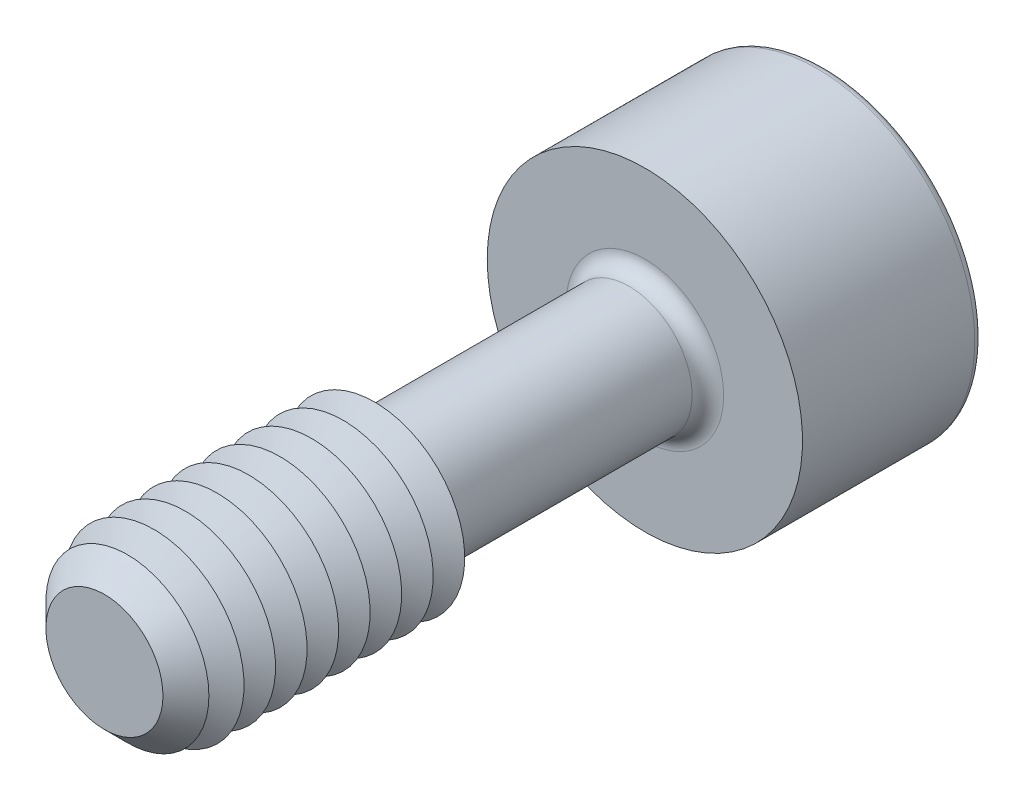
ISO-10303-21;
HEADER;
FILE_DESCRIPTION(('STEP AP214'),'2;1');
FILE_NAME('part.step','',(''),(''),'','','');
FILE_SCHEMA(('AUTOMOTIVE_DESIGN { 1 0 10303 214 1 1 1 1 }'));
ENDSEC;
DATA;
#1=APPLICATION_CONTEXT('core data for automotive mechanical design processes');
#2=APPLICATION_PROTOCOL_DEFINITION('international standard','automotive_design',2000,#1);
#3=PRODUCT_CONTEXT('',#1,'mechanical');
#4=PRODUCT('Part','Part','',(#3));
#5=PRODUCT_RELATED_PRODUCT_CATEGORY('part','',(#4));
#6=PRODUCT_DEFINITION_FORMATION('','',#4);
#7=PRODUCT_DEFINITION_CONTEXT('part definition',#1,'design');
#8=PRODUCT_DEFINITION('design','',#6,#7);
#9=PRODUCT_DEFINITION_SHAPE('','',#8);
#10=(LENGTH_UNIT() NAMED_UNIT(*) SI_UNIT(.MILLI.,.METRE.));
#11=(NAMED_UNIT(*) PLANE_ANGLE_UNIT() SI_UNIT($,.RADIAN.));
#12=(NAMED_UNIT(*) SI_UNIT($,.STERADIAN.) SOLID_ANGLE_UNIT());
#13=UNCERTAINTY_MEASURE_WITH_UNIT(LENGTH_MEASURE(1.E-05),#10,'distance_accuracy_value','');
#14=(GEOMETRIC_REPRESENTATION_CONTEXT(3) GLOBAL_UNCERTAINTY_ASSIGNED_CONTEXT((#13)) GLOBAL_UNIT_ASSIGNED_CONTEXT((#10,
#11,#12)) REPRESENTATION_CONTEXT('',''));
#15=CARTESIAN_POINT('',(0.,0.,0.));
#16=DIRECTION('',(0.,0.,1.));
#17=DIRECTION('',(1.,0.,0.));
#18=AXIS2_PLACEMENT_3D('',#15,#16,#17);
#19=CARTESIAN_POINT('',(-0.866025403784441,-1.5,-7.));
#20=DIRECTION('',(0.,0.,1.));
#21=DIRECTION('',(1.,0.,0.));
#22=AXIS2_PLACEMENT_3D('',#19,#20,#21);
#23=PLANE('',#22);
#24=DIRECTION('',(1.,0.,0.));
#25=VECTOR('',#24,1.);
#26=CARTESIAN_POINT('',(-0.866025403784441,-1.5,-7.));
#27=LINE('',#26,#25);
#28=CARTESIAN_POINT('',(0.,-1.5,-7.));
#29=VERTEX_POINT('',#28);
#30=CARTESIAN_POINT('',(0.866025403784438,-1.5,-7.));
#31=VERTEX_POINT('',#30);
#32=EDGE_CURVE('E765',#29,#31,#27,.T.);
#33=ORIENTED_EDGE('',*,*,#32,.F.);
#34=CARTESIAN_POINT('',(0.,0.,-7.));
#35=DIRECTION('',(0.,0.,1.));
#36=DIRECTION('',(0.,-1.,0.));
#37=AXIS2_PLACEMENT_3D('',#34,#35,#36);
#38=CIRCLE('',#37,1.5);
#39=CARTESIAN_POINT('',(1.29903810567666,-0.750000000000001,-7.));
#40=VERTEX_POINT('',#39);
#41=EDGE_CURVE('E53',#29,#40,#38,.T.);
#42=ORIENTED_EDGE('',*,*,#41,.T.);
#43=DIRECTION('',(0.5,0.866025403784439,0.));
#44=VECTOR('',#43,1.);
#45=CARTESIAN_POINT('',(0.866025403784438,-1.5,-7.));
#46=LINE('',#45,#44);
#47=EDGE_CURVE('E750',#31,#40,#46,.T.);
#48=ORIENTED_EDGE('',*,*,#47,.F.);
#49=EDGE_LOOP('',(#33,#42,#48));
#50=FACE_BOUND('',#49,.T.);
#51=ADVANCED_FACE('F41',(#50),#23,.F.);
#52=CARTESIAN_POINT('',(1.73205080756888,0.,-7.));
#53=VERTEX_POINT('',#52);
#54=EDGE_CURVE('E761',#40,#53,#46,.T.);
#55=ORIENTED_EDGE('',*,*,#54,.F.);
#56=CARTESIAN_POINT('',(1.29903810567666,0.75,-7.));
#57=VERTEX_POINT('',#56);
#58=EDGE_CURVE('E11',#40,#57,#38,.T.);
#59=ORIENTED_EDGE('',*,*,#58,.T.);
#60=DIRECTION('',(-0.5,0.866025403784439,0.));
#61=VECTOR('',#60,1.);
#62=CARTESIAN_POINT('',(1.73205080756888,0.,-7.));
#63=LINE('',#62,#61);
#64=EDGE_CURVE('E749',#53,#57,#63,.T.);
#65=ORIENTED_EDGE('',*,*,#64,.F.);
#66=EDGE_LOOP('',(#55,#59,#65));
#67=FACE_BOUND('',#66,.T.);
#68=ADVANCED_FACE('F133',(#67),#23,.F.);
#69=CARTESIAN_POINT('',(0.866025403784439,1.5,-7.));
#70=VERTEX_POINT('',#69);
#71=EDGE_CURVE('E744',#57,#70,#63,.T.);
#72=ORIENTED_EDGE('',*,*,#71,.F.);
#73=CARTESIAN_POINT('',(0.,1.5,-7.));
#74=VERTEX_POINT('',#73);
#75=EDGE_CURVE('E51',#57,#74,#38,.T.);
#76=ORIENTED_EDGE('',*,*,#75,.T.);
#77=DIRECTION('',(-1.,0.,0.));
#78=VECTOR('',#77,1.);
#79=CARTESIAN_POINT('',(0.866025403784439,1.5,-7.));
#80=LINE('',#79,#78);
#81=EDGE_CURVE('E177',#70,#74,#80,.T.);
#82=ORIENTED_EDGE('',*,*,#81,.F.);
#83=EDGE_LOOP('',(#72,#76,#82));
#84=FACE_BOUND('',#83,.T.);
#85=ADVANCED_FACE('F139',(#84),#23,.F.);
#86=CARTESIAN_POINT('',(-0.866025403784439,1.5,-7.));
#87=VERTEX_POINT('',#86);
#88=EDGE_CURVE('E755',#74,#87,#80,.T.);
#89=ORIENTED_EDGE('',*,*,#88,.F.);
#90=CARTESIAN_POINT('',(-1.29903810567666,0.750000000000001,-7.));
#91=VERTEX_POINT('',#90);
#92=EDGE_CURVE('E265',#74,#91,#38,.T.);
#93=ORIENTED_EDGE('',*,*,#92,.T.);
#94=DIRECTION('',(-0.5,-0.866025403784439,0.));
#95=VECTOR('',#94,1.);
#96=CARTESIAN_POINT('',(-0.866025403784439,1.5,-7.));
#97=LINE('',#96,#95);
#98=EDGE_CURVE('E176',#87,#91,#97,.T.);
#99=ORIENTED_EDGE('',*,*,#98,.F.);
#100=EDGE_LOOP('',(#89,#93,#99));
#101=FACE_BOUND('',#100,.T.);
#102=ADVANCED_FACE('F157',(#101),#23,.F.);
#103=CARTESIAN_POINT('',(-1.73205080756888,0.,-7.));
#104=VERTEX_POINT('',#103);
#105=EDGE_CURVE('E170',#91,#104,#97,.T.);
#106=ORIENTED_EDGE('',*,*,#105,.F.);
#107=CARTESIAN_POINT('',(-1.29903810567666,-0.75,-7.));
#108=VERTEX_POINT('',#107);
#109=EDGE_CURVE('E172',#91,#108,#38,.T.);
#110=ORIENTED_EDGE('',*,*,#109,.T.);
#111=DIRECTION('',(0.5,-0.866025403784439,0.));
#112=VECTOR('',#111,1.);
#113=CARTESIAN_POINT('',(-1.73205080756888,0.,-7.));
#114=LINE('',#113,#112);
#115=EDGE_CURVE('E174',#104,#108,#114,.T.);
#116=ORIENTED_EDGE('',*,*,#115,.F.);
#117=EDGE_LOOP('',(#106,#110,#116));
#118=FACE_BOUND('',#117,.T.);
#119=ADVANCED_FACE('F146',(#118),#23,.F.);
#120=CARTESIAN_POINT('',(0.,0.,-10.));
#121=DIRECTION('',(0.,0.,-1.));
#122=DIRECTION('',(-1.,0.,0.));
#123=AXIS2_PLACEMENT_3D('',#120,#121,#122);
#124=PLANE('',#123);
#125=CARTESIAN_POINT('',(0.,0.,-10.));
#126=DIRECTION('',(0.,0.,-1.));
#127=DIRECTION('',(-1.,0.,0.));
#128=AXIS2_PLACEMENT_3D('',#125,#126,#127);
#129=CIRCLE('',#128,3.325);
#130=CARTESIAN_POINT('',(-3.325,0.,-10.));
#131=VERTEX_POINT('',#130);
#132=EDGE_CURVE('E251',#131,#131,#129,.T.);
#133=ORIENTED_EDGE('',*,*,#132,.T.);
#134=EDGE_LOOP('',(#133));
#135=FACE_BOUND('',#134,.T.);
#136=DIRECTION('',(-0.5,-0.866025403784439,0.));
#137=VECTOR('',#136,1.);
#138=CARTESIAN_POINT('',(-0.866025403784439,1.5,-10.));
#139=LINE('',#138,#137);
#140=CARTESIAN_POINT('',(-0.866025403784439,1.5,-10.));
#141=VERTEX_POINT('',#140);
#142=CARTESIAN_POINT('',(-1.73205080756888,0.,-10.));
#143=VERTEX_POINT('',#142);
#144=EDGE_CURVE('E212',#141,#143,#139,.T.);
#145=ORIENTED_EDGE('',*,*,#144,.T.);
#146=DIRECTION('',(0.5,-0.866025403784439,0.));
#147=VECTOR('',#146,1.);
#148=CARTESIAN_POINT('',(-1.73205080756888,0.,-10.));
#149=LINE('',#148,#147);
#150=CARTESIAN_POINT('',(-0.866025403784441,-1.5,-10.));
#151=VERTEX_POINT('',#150);
#152=EDGE_CURVE('E67',#143,#151,#149,.T.);
#153=ORIENTED_EDGE('',*,*,#152,.T.);
#154=DIRECTION('',(1.,0.,0.));
#155=VECTOR('',#154,1.);
#156=CARTESIAN_POINT('',(-0.866025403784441,-1.5,-10.));
#157=LINE('',#156,#155);
#158=CARTESIAN_POINT('',(0.866025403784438,-1.5,-10.));
#159=VERTEX_POINT('',#158);
#160=EDGE_CURVE('E196',#151,#159,#157,.T.);
#161=ORIENTED_EDGE('',*,*,#160,.T.);
#162=DIRECTION('',(0.5,0.866025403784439,0.));
#163=VECTOR('',#162,1.);
#164=CARTESIAN_POINT('',(0.866025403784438,-1.5,-10.));
#165=LINE('',#164,#163);
#166=CARTESIAN_POINT('',(1.73205080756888,0.,-10.));
#167=VERTEX_POINT('',#166);
#168=EDGE_CURVE('E200',#159,#167,#165,.T.);
#169=ORIENTED_EDGE('',*,*,#168,.T.);
#170=DIRECTION('',(-0.5,0.866025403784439,0.));
#171=VECTOR('',#170,1.);
#172=CARTESIAN_POINT('',(1.73205080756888,0.,-10.));
#173=LINE('',#172,#171);
#174=CARTESIAN_POINT('',(0.866025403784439,1.5,-10.));
#175=VERTEX_POINT('',#174);
#176=EDGE_CURVE('E204',#167,#175,#173,.T.);
#177=ORIENTED_EDGE('',*,*,#176,.T.);
#178=DIRECTION('',(-1.,0.,0.));
#179=VECTOR('',#178,1.);
#180=CARTESIAN_POINT('',(0.866025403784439,1.5,-10.));
#181=LINE('',#180,#179);
#182=EDGE_CURVE('E208',#175,#141,#181,.T.);
#183=ORIENTED_EDGE('',*,*,#182,.T.);
#184=EDGE_LOOP('',(#145,#153,#161,#169,#177,#183));
#185=FACE_BOUND('',#184,.T.);
#186=ADVANCED_FACE('F156',(#135,#185),#124,.T.);
#187=CARTESIAN_POINT('',(0.,0.,6.));
#188=DIRECTION('',(0.,0.,-1.));
#189=DIRECTION('',(-1.,0.,0.));
#190=AXIS2_PLACEMENT_3D('',#187,#188,#189);
#191=CYLINDRICAL_SURFACE('',#190,1.4);
#192=CARTESIAN_POINT('',(0.,0.,-5.65));
#193=DIRECTION('',(0.,0.,-1.));
#194=DIRECTION('',(-1.,0.,0.));
#195=AXIS2_PLACEMENT_3D('',#192,#193,#194);
#196=CIRCLE('',#195,1.4);
#197=CARTESIAN_POINT('',(-1.4,0.,-5.65));
#198=VERTEX_POINT('',#197);
#199=EDGE_CURVE('E247',#198,#198,#196,.F.);
#200=ORIENTED_EDGE('',*,*,#199,.T.);
#201=EDGE_LOOP('',(#200));
#202=FACE_BOUND('',#201,.T.);
#203=CARTESIAN_POINT('',(0.,0.,-0.346410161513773));
#204=DIRECTION('',(0.,0.,-1.));
#205=DIRECTION('',(0.,1.,0.));
#206=AXIS2_PLACEMENT_3D('',#203,#204,#205);
#207=CIRCLE('',#206,1.4);
#208=CARTESIAN_POINT('',(0.,1.4,-0.346410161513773));
#209=VERTEX_POINT('',#208);
#210=EDGE_CURVE('E235',#209,#209,#207,.T.);
#211=ORIENTED_EDGE('',*,*,#210,.T.);
#212=EDGE_LOOP('',(#211));
#213=FACE_BOUND('',#212,.T.);
#214=ADVANCED_FACE('F163',(#202,#213),#191,.T.);
#215=CARTESIAN_POINT('',(0.,0.,-0.346410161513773));
#216=DIRECTION('',(0.,0.,1.));
#217=DIRECTION('',(0.,-1.,0.));
#218=AXIS2_PLACEMENT_3D('',#215,#216,#217);
#219=CONICAL_SURFACE('',#218,1.4,1.0471975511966);
#220=CARTESIAN_POINT('',(0.,0.,0.));
#221=DIRECTION('',(0.,0.,-1.));
#222=DIRECTION('',(-1.,0.,0.));
#223=AXIS2_PLACEMENT_3D('',#220,#221,#222);
#224=CIRCLE('',#223,2.);
#225=CARTESIAN_POINT('',(-2.,0.,0.));
#226=VERTEX_POINT('',#225);
#227=EDGE_CURVE('E269',#226,#226,#224,.T.);
#228=ORIENTED_EDGE('',*,*,#227,.T.);
#229=EDGE_LOOP('',(#228));
#230=FACE_BOUND('',#229,.T.);
#231=ORIENTED_EDGE('',*,*,#210,.F.);
#232=EDGE_LOOP('',(#231));
#233=FACE_BOUND('',#232,.T.);
#234=ADVANCED_FACE('F513',(#230,#233),#219,.T.);
#235=CARTESIAN_POINT('',(0.,0.,-6.));
#236=DIRECTION('',(0.,0.,-1.));
#237=DIRECTION('',(-1.,0.,0.));
#238=AXIS2_PLACEMENT_3D('',#235,#236,#237);
#239=PLANE('',#238);
#240=CARTESIAN_POINT('',(0.,0.,-6.));
#241=DIRECTION('',(0.,0.,-1.));
#242=DIRECTION('',(-1.,0.,0.));
#243=AXIS2_PLACEMENT_3D('',#240,#241,#242);
#244=CIRCLE('',#243,1.75);
#245=CARTESIAN_POINT('',(-1.75,0.,-6.));
#246=VERTEX_POINT('',#245);
#247=EDGE_CURVE('E243',#246,#246,#244,.T.);
#248=ORIENTED_EDGE('',*,*,#247,.T.);
#249=EDGE_LOOP('',(#248));
#250=FACE_BOUND('',#249,.T.);
#251=CARTESIAN_POINT('',(0.,0.,-6.));
#252=DIRECTION('',(0.,0.,-1.));
#253=DIRECTION('',(-1.,0.,0.));
#254=AXIS2_PLACEMENT_3D('',#251,#252,#253);
#255=CIRCLE('',#254,3.5);
#256=CARTESIAN_POINT('',(-3.5,0.,-6.));
#257=VERTEX_POINT('',#256);
#258=EDGE_CURVE('E231',#257,#257,#255,.T.);
#259=ORIENTED_EDGE('',*,*,#258,.F.);
#260=EDGE_LOOP('',(#259));
#261=FACE_BOUND('',#260,.T.);
#262=ADVANCED_FACE('F506',(#250,#261),#239,.F.);
#263=CARTESIAN_POINT('',(0.,0.,-10.));
#264=DIRECTION('',(0.,0.,1.));
#265=DIRECTION('',(1.,0.,0.));
#266=AXIS2_PLACEMENT_3D('',#263,#264,#265);
#267=CYLINDRICAL_SURFACE('',#266,3.5);
#268=CARTESIAN_POINT('',(0.,0.,-9.825));
#269=DIRECTION('',(0.,0.,-1.));
#270=DIRECTION('',(-1.,0.,0.));
#271=AXIS2_PLACEMENT_3D('',#268,#269,#270);
#272=CIRCLE('',#271,3.5);
#273=CARTESIAN_POINT('',(-3.5,0.,-9.825));
#274=VERTEX_POINT('',#273);
#275=EDGE_CURVE('E254',#274,#274,#272,.F.);
#276=ORIENTED_EDGE('',*,*,#275,.T.);
#277=EDGE_LOOP('',(#276));
#278=FACE_BOUND('',#277,.T.);
#279=ORIENTED_EDGE('',*,*,#258,.T.);
#280=EDGE_LOOP('',(#279));
#281=FACE_BOUND('',#280,.T.);
#282=ADVANCED_FACE('F512',(#278,#281),#267,.T.);
#283=CARTESIAN_POINT('',(-1.73205080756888,0.,-7.));
#284=DIRECTION('',(0.866025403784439,0.5,0.));
#285=DIRECTION('',(-0.5,0.866025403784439,0.));
#286=AXIS2_PLACEMENT_3D('',#283,#284,#285);
#287=PLANE('',#286);
#288=ORIENTED_EDGE('',*,*,#152,.F.);
#289=DIRECTION('',(0.,0.,-1.));
#290=VECTOR('',#289,1.);
#291=CARTESIAN_POINT('',(-1.73205080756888,0.,-7.));
#292=LINE('',#291,#290);
#293=EDGE_CURVE('E186',#104,#143,#292,.T.);
#294=ORIENTED_EDGE('',*,*,#293,.F.);
#295=ORIENTED_EDGE('',*,*,#115,.T.);
#296=CARTESIAN_POINT('',(-0.866025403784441,-1.5,-7.));
#297=VERTEX_POINT('',#296);
#298=EDGE_CURVE('E215',#108,#297,#114,.T.);
#299=ORIENTED_EDGE('',*,*,#298,.T.);
#300=DIRECTION('',(0.,0.,-1.));
#301=VECTOR('',#300,1.);
#302=CARTESIAN_POINT('',(-0.866025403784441,-1.5,-7.));
#303=LINE('',#302,#301);
#304=EDGE_CURVE('E228',#297,#151,#303,.T.);
#305=ORIENTED_EDGE('',*,*,#304,.T.);
#306=EDGE_LOOP('',(#288,#294,#295,#299,#305));
#307=FACE_BOUND('',#306,.T.);
#308=ADVANCED_FACE('F524',(#307),#287,.T.);
#309=CARTESIAN_POINT('',(-0.866025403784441,-1.5,-7.));
#310=DIRECTION('',(0.,1.,0.));
#311=DIRECTION('',(-1.,0.,0.));
#312=AXIS2_PLACEMENT_3D('',#309,#310,#311);
#313=PLANE('',#312);
#314=ORIENTED_EDGE('',*,*,#160,.F.);
#315=ORIENTED_EDGE('',*,*,#304,.F.);
#316=EDGE_CURVE('E762',#297,#29,#27,.T.);
#317=ORIENTED_EDGE('',*,*,#316,.T.);
#318=ORIENTED_EDGE('',*,*,#32,.T.);
#319=DIRECTION('',(0.,0.,-1.));
#320=VECTOR('',#319,1.);
#321=CARTESIAN_POINT('',(0.866025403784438,-1.5,-7.));
#322=LINE('',#321,#320);
#323=EDGE_CURVE('E225',#31,#159,#322,.T.);
#324=ORIENTED_EDGE('',*,*,#323,.T.);
#325=EDGE_LOOP('',(#314,#315,#317,#318,#324));
#326=FACE_BOUND('',#325,.T.);
#327=ADVANCED_FACE('F540',(#326),#313,.T.);
#328=CARTESIAN_POINT('',(0.866025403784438,-1.5,-7.));
#329=DIRECTION('',(-0.866025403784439,0.5,0.));
#330=DIRECTION('',(-0.5,-0.866025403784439,0.));
#331=AXIS2_PLACEMENT_3D('',#328,#329,#330);
#332=PLANE('',#331);
#333=ORIENTED_EDGE('',*,*,#168,.F.);
#334=ORIENTED_EDGE('',*,*,#323,.F.);
#335=ORIENTED_EDGE('',*,*,#47,.T.);
#336=ORIENTED_EDGE('',*,*,#54,.T.);
#337=DIRECTION('',(0.,0.,-1.));
#338=VECTOR('',#337,1.);
#339=CARTESIAN_POINT('',(1.73205080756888,0.,-7.));
#340=LINE('',#339,#338);
#341=EDGE_CURVE('E222',#53,#167,#340,.T.);
#342=ORIENTED_EDGE('',*,*,#341,.T.);
#343=EDGE_LOOP('',(#333,#334,#335,#336,#342));
#344=FACE_BOUND('',#343,.T.);
#345=ADVANCED_FACE('F550',(#344),#332,.T.);
#346=CARTESIAN_POINT('',(1.73205080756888,0.,-7.));
#347=DIRECTION('',(-0.866025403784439,-0.5,0.));
#348=DIRECTION('',(0.5,-0.866025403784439,0.));
#349=AXIS2_PLACEMENT_3D('',#346,#347,#348);
#350=PLANE('',#349);
#351=ORIENTED_EDGE('',*,*,#176,.F.);
#352=ORIENTED_EDGE('',*,*,#341,.F.);
#353=ORIENTED_EDGE('',*,*,#64,.T.);
#354=ORIENTED_EDGE('',*,*,#71,.T.);
#355=DIRECTION('',(0.,0.,-1.));
#356=VECTOR('',#355,1.);
#357=CARTESIAN_POINT('',(0.866025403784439,1.5,-7.));
#358=LINE('',#357,#356);
#359=EDGE_CURVE('E219',#70,#175,#358,.T.);
#360=ORIENTED_EDGE('',*,*,#359,.T.);
#361=EDGE_LOOP('',(#351,#352,#353,#354,#360));
#362=FACE_BOUND('',#361,.T.);
#363=ADVANCED_FACE('F560',(#362),#350,.T.);
#364=CARTESIAN_POINT('',(0.866025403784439,1.5,-7.));
#365=DIRECTION('',(0.,-1.,0.));
#366=DIRECTION('',(0.,0.,-1.));
#367=AXIS2_PLACEMENT_3D('',#364,#365,#366);
#368=PLANE('',#367);
#369=ORIENTED_EDGE('',*,*,#182,.F.);
#370=ORIENTED_EDGE('',*,*,#359,.F.);
#371=ORIENTED_EDGE('',*,*,#81,.T.);
#372=ORIENTED_EDGE('',*,*,#88,.T.);
#373=DIRECTION('',(0.,0.,-1.));
#374=VECTOR('',#373,1.);
#375=CARTESIAN_POINT('',(-0.866025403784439,1.5,-7.));
#376=LINE('',#375,#374);
#377=EDGE_CURVE('E182',#87,#141,#376,.T.);
#378=ORIENTED_EDGE('',*,*,#377,.T.);
#379=EDGE_LOOP('',(#369,#370,#371,#372,#378));
#380=FACE_BOUND('',#379,.T.);
#381=ADVANCED_FACE('F152',(#380),#368,.T.);
#382=CARTESIAN_POINT('',(-0.866025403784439,1.5,-7.));
#383=DIRECTION('',(0.866025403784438,-0.5,0.));
#384=DIRECTION('',(0.5,0.866025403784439,0.));
#385=AXIS2_PLACEMENT_3D('',#382,#383,#384);
#386=PLANE('',#385);
#387=ORIENTED_EDGE('',*,*,#144,.F.);
#388=ORIENTED_EDGE('',*,*,#377,.F.);
#389=ORIENTED_EDGE('',*,*,#98,.T.);
#390=ORIENTED_EDGE('',*,*,#105,.T.);
#391=ORIENTED_EDGE('',*,*,#293,.T.);
#392=EDGE_LOOP('',(#387,#388,#389,#390,#391));
#393=FACE_BOUND('',#392,.T.);
#394=ADVANCED_FACE('F144',(#393),#386,.T.);
#395=ORIENTED_EDGE('',*,*,#298,.F.);
#396=EDGE_CURVE('E257',#108,#29,#38,.T.);
#397=ORIENTED_EDGE('',*,*,#396,.T.);
#398=ORIENTED_EDGE('',*,*,#316,.F.);
#399=EDGE_LOOP('',(#395,#397,#398));
#400=FACE_BOUND('',#399,.T.);
#401=ADVANCED_FACE('F135',(#400),#23,.F.);
#402=CARTESIAN_POINT('',(0.,0.,-5.65));
#403=DIRECTION('',(0.,0.,-1.));
#404=DIRECTION('',(-1.,0.,0.));
#405=AXIS2_PLACEMENT_3D('',#402,#403,#404);
#406=TOROIDAL_SURFACE('',#405,1.75,0.35);
#407=ORIENTED_EDGE('',*,*,#199,.F.);
#408=EDGE_LOOP('',(#407));
#409=FACE_BOUND('',#408,.T.);
#410=ORIENTED_EDGE('',*,*,#247,.F.);
#411=EDGE_LOOP('',(#410));
#412=FACE_BOUND('',#411,.T.);
#413=ADVANCED_FACE('F129',(#409,#412),#406,.F.);
#414=CARTESIAN_POINT('',(0.,0.,-9.825));
#415=DIRECTION('',(0.,0.,-1.));
#416=DIRECTION('',(-1.,0.,0.));
#417=AXIS2_PLACEMENT_3D('',#414,#415,#416);
#418=TOROIDAL_SURFACE('',#417,3.325,0.175);
#419=ORIENTED_EDGE('',*,*,#275,.F.);
#420=EDGE_LOOP('',(#419));
#421=FACE_BOUND('',#420,.T.);
#422=ORIENTED_EDGE('',*,*,#132,.F.);
#423=EDGE_LOOP('',(#422));
#424=FACE_BOUND('',#423,.T.);
#425=ADVANCED_FACE('F43',(#421,#424),#418,.T.);
#426=CARTESIAN_POINT('',(0.,0.,-6.13397459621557));
#427=DIRECTION('',(0.,0.,-1.));
#428=DIRECTION('',(0.,1.,0.));
#429=AXIS2_PLACEMENT_3D('',#426,#427,#428);
#430=CONICAL_SURFACE('',#429,0.,1.0471975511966);
#431=ORIENTED_EDGE('',*,*,#41,.F.);
#432=ORIENTED_EDGE('',*,*,#396,.F.);
#433=ORIENTED_EDGE('',*,*,#109,.F.);
#434=ORIENTED_EDGE('',*,*,#92,.F.);
#435=ORIENTED_EDGE('',*,*,#75,.F.);
#436=ORIENTED_EDGE('',*,*,#58,.F.);
#437=EDGE_LOOP('',(#431,#432,#433,#434,#435,#436));
#438=FACE_BOUND('',#437,.T.);
#439=CARTESIAN_POINT('',(0.,0.,-6.13397459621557));
#440=VERTEX_POINT('',#439);
#441=VERTEX_LOOP('',#440);
#442=FACE_BOUND('',#441,.T.);
#443=ADVANCED_FACE('F118',(#438,#442),#430,.F.);
#444=CARTESIAN_POINT('',(0.,0.,0.350000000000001));
#445=DIRECTION('',(0.,0.,-1.));
#446=DIRECTION('',(-1.,0.,0.));
#447=AXIS2_PLACEMENT_3D('',#444,#445,#446);
#448=CONICAL_SURFACE('',#447,1.39378221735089,1.04719755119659);
#449=ORIENTED_EDGE('',*,*,#227,.F.);
#450=EDGE_LOOP('',(#449));
#451=FACE_BOUND('',#450,.T.);
#452=CARTESIAN_POINT('',(0.,0.,0.350000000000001));
#453=DIRECTION('',(0.,0.,-1.));
#454=DIRECTION('',(-1.,0.,0.));
#455=AXIS2_PLACEMENT_3D('',#452,#453,#454);
#456=CIRCLE('',#455,1.39378221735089);
#457=CARTESIAN_POINT('',(-1.39378221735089,0.,0.350000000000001));
#458=VERTEX_POINT('',#457);
#459=EDGE_CURVE('E276',#458,#458,#456,.T.);
#460=ORIENTED_EDGE('',*,*,#459,.T.);
#461=EDGE_LOOP('',(#460));
#462=FACE_BOUND('',#461,.T.);
#463=ADVANCED_FACE('F120',(#451,#462),#448,.T.);
#464=CARTESIAN_POINT('',(0.,0.,0.699999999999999));
#465=DIRECTION('',(0.,0.,1.));
#466=DIRECTION('',(1.,0.,0.));
#467=AXIS2_PLACEMENT_3D('',#464,#465,#466);
#468=CONICAL_SURFACE('',#467,2.,1.0471975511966);
#469=ORIENTED_EDGE('',*,*,#459,.F.);
#470=EDGE_LOOP('',(#469));
#471=FACE_BOUND('',#470,.T.);
#472=CARTESIAN_POINT('',(0.,0.,0.7));
#473=DIRECTION('',(0.,0.,-1.));
#474=DIRECTION('',(-1.,0.,0.));
#475=AXIS2_PLACEMENT_3D('',#472,#473,#474);
#476=CIRCLE('',#475,2.);
#477=CARTESIAN_POINT('',(-2.,0.,0.7));
#478=VERTEX_POINT('',#477);
#479=EDGE_CURVE('E281',#478,#478,#476,.T.);
#480=ORIENTED_EDGE('',*,*,#479,.T.);
#481=EDGE_LOOP('',(#480));
#482=FACE_BOUND('',#481,.T.);
#483=ADVANCED_FACE('F126',(#471,#482),#468,.T.);
#484=CARTESIAN_POINT('',(0.,0.,1.05));
#485=DIRECTION('',(0.,0.,-1.));
#486=DIRECTION('',(-1.,0.,0.));
#487=AXIS2_PLACEMENT_3D('',#484,#485,#486);
#488=CONICAL_SURFACE('',#487,1.39378221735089,1.04719755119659);
#489=ORIENTED_EDGE('',*,*,#479,.F.);
#490=EDGE_LOOP('',(#489));
#491=FACE_BOUND('',#490,.T.);
#492=CARTESIAN_POINT('',(0.,0.,1.05));
#493=DIRECTION('',(0.,0.,-1.));
#494=DIRECTION('',(-1.,0.,0.));
#495=AXIS2_PLACEMENT_3D('',#492,#493,#494);
#496=CIRCLE('',#495,1.39378221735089);
#497=CARTESIAN_POINT('',(-1.39378221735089,0.,1.05));
#498=VERTEX_POINT('',#497);
#499=EDGE_CURVE('E287',#498,#498,#496,.T.);
#500=ORIENTED_EDGE('',*,*,#499,.T.);
#501=EDGE_LOOP('',(#500));
#502=FACE_BOUND('',#501,.T.);
#503=ADVANCED_FACE('F400',(#491,#502),#488,.T.);
#504=CARTESIAN_POINT('',(0.,0.,1.4));
#505=DIRECTION('',(0.,0.,1.));
#506=DIRECTION('',(1.,0.,0.));
#507=AXIS2_PLACEMENT_3D('',#504,#505,#506);
#508=CONICAL_SURFACE('',#507,2.,1.0471975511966);
#509=ORIENTED_EDGE('',*,*,#499,.F.);
#510=EDGE_LOOP('',(#509));
#511=FACE_BOUND('',#510,.T.);
#512=CARTESIAN_POINT('',(0.,0.,1.4));
#513=DIRECTION('',(0.,0.,-1.));
#514=DIRECTION('',(-1.,0.,0.));
#515=AXIS2_PLACEMENT_3D('',#512,#513,#514);
#516=CIRCLE('',#515,2.);
#517=CARTESIAN_POINT('',(-2.,0.,1.4));
#518=VERTEX_POINT('',#517);
#519=EDGE_CURVE('E291',#518,#518,#516,.T.);
#520=ORIENTED_EDGE('',*,*,#519,.T.);
#521=EDGE_LOOP('',(#520));
#522=FACE_BOUND('',#521,.T.);
#523=ADVANCED_FACE('F396',(#511,#522),#508,.T.);
#524=CARTESIAN_POINT('',(0.,0.,1.75));
#525=DIRECTION('',(0.,0.,-1.));
#526=DIRECTION('',(-1.,0.,0.));
#527=AXIS2_PLACEMENT_3D('',#524,#525,#526);
#528=CONICAL_SURFACE('',#527,1.39378221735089,1.04719755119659);
#529=ORIENTED_EDGE('',*,*,#519,.F.);
#530=EDGE_LOOP('',(#529));
#531=FACE_BOUND('',#530,.T.);
#532=CARTESIAN_POINT('',(0.,0.,1.75));
#533=DIRECTION('',(0.,0.,-1.));
#534=DIRECTION('',(-1.,0.,0.));
#535=AXIS2_PLACEMENT_3D('',#532,#533,#534);
#536=CIRCLE('',#535,1.39378221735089);
#537=CARTESIAN_POINT('',(-1.39378221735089,0.,1.75));
#538=VERTEX_POINT('',#537);
#539=EDGE_CURVE('E295',#538,#538,#536,.T.);
#540=ORIENTED_EDGE('',*,*,#539,.T.);
#541=EDGE_LOOP('',(#540));
#542=FACE_BOUND('',#541,.T.);
#543=ADVANCED_FACE('F392',(#531,#542),#528,.T.);
#544=CARTESIAN_POINT('',(0.,0.,2.1));
#545=DIRECTION('',(0.,0.,1.));
#546=DIRECTION('',(1.,0.,0.));
#547=AXIS2_PLACEMENT_3D('',#544,#545,#546);
#548=CONICAL_SURFACE('',#547,2.,1.0471975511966);
#549=ORIENTED_EDGE('',*,*,#539,.F.);
#550=EDGE_LOOP('',(#549));
#551=FACE_BOUND('',#550,.T.);
#552=CARTESIAN_POINT('',(0.,0.,2.1));
#553=DIRECTION('',(0.,0.,-1.));
#554=DIRECTION('',(-1.,0.,0.));
#555=AXIS2_PLACEMENT_3D('',#552,#553,#554);
#556=CIRCLE('',#555,2.);
#557=CARTESIAN_POINT('',(-2.,0.,2.1));
#558=VERTEX_POINT('',#557);
#559=EDGE_CURVE('E299',#558,#558,#556,.T.);
#560=ORIENTED_EDGE('',*,*,#559,.T.);
#561=EDGE_LOOP('',(#560));
#562=FACE_BOUND('',#561,.T.);
#563=ADVANCED_FACE('F388',(#551,#562),#548,.T.);
#564=CARTESIAN_POINT('',(0.,0.,2.45));
#565=DIRECTION('',(0.,0.,-1.));
#566=DIRECTION('',(-1.,0.,0.));
#567=AXIS2_PLACEMENT_3D('',#564,#565,#566);
#568=CONICAL_SURFACE('',#567,1.39378221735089,1.04719755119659);
#569=ORIENTED_EDGE('',*,*,#559,.F.);
#570=EDGE_LOOP('',(#569));
#571=FACE_BOUND('',#570,.T.);
#572=CARTESIAN_POINT('',(0.,0.,2.45));
#573=DIRECTION('',(0.,0.,-1.));
#574=DIRECTION('',(-1.,0.,0.));
#575=AXIS2_PLACEMENT_3D('',#572,#573,#574);
#576=CIRCLE('',#575,1.39378221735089);
#577=CARTESIAN_POINT('',(-1.39378221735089,0.,2.45));
#578=VERTEX_POINT('',#577);
#579=EDGE_CURVE('E302',#578,#578,#576,.T.);
#580=ORIENTED_EDGE('',*,*,#579,.T.);
#581=EDGE_LOOP('',(#580));
#582=FACE_BOUND('',#581,.T.);
#583=ADVANCED_FACE('F384',(#571,#582),#568,.T.);
#584=CARTESIAN_POINT('',(0.,0.,2.8));
#585=DIRECTION('',(0.,0.,1.));
#586=DIRECTION('',(1.,0.,0.));
#587=AXIS2_PLACEMENT_3D('',#584,#585,#586);
#588=CONICAL_SURFACE('',#587,2.,1.0471975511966);
#589=ORIENTED_EDGE('',*,*,#579,.F.);
#590=EDGE_LOOP('',(#589));
#591=FACE_BOUND('',#590,.T.);
#592=CARTESIAN_POINT('',(0.,0.,2.8));
#593=DIRECTION('',(0.,0.,-1.));
#594=DIRECTION('',(-1.,0.,0.));
#595=AXIS2_PLACEMENT_3D('',#592,#593,#594);
#596=CIRCLE('',#595,2.);
#597=CARTESIAN_POINT('',(-2.,0.,2.8));
#598=VERTEX_POINT('',#597);
#599=EDGE_CURVE('E305',#598,#598,#596,.T.);
#600=ORIENTED_EDGE('',*,*,#599,.T.);
#601=EDGE_LOOP('',(#600));
#602=FACE_BOUND('',#601,.T.);
#603=ADVANCED_FACE('F380',(#591,#602),#588,.T.);
#604=CARTESIAN_POINT('',(0.,0.,3.15));
#605=DIRECTION('',(0.,0.,-1.));
#606=DIRECTION('',(-1.,0.,0.));
#607=AXIS2_PLACEMENT_3D('',#604,#605,#606);
#608=CONICAL_SURFACE('',#607,1.39378221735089,1.04719755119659);
#609=ORIENTED_EDGE('',*,*,#599,.F.);
#610=EDGE_LOOP('',(#609));
#611=FACE_BOUND('',#610,.T.);
#612=CARTESIAN_POINT('',(0.,0.,3.15));
#613=DIRECTION('',(0.,0.,-1.));
#614=DIRECTION('',(-1.,0.,0.));
#615=AXIS2_PLACEMENT_3D('',#612,#613,#614);
#616=CIRCLE('',#615,1.39378221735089);
#617=CARTESIAN_POINT('',(-1.39378221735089,0.,3.15));
#618=VERTEX_POINT('',#617);
#619=EDGE_CURVE('E309',#618,#618,#616,.T.);
#620=ORIENTED_EDGE('',*,*,#619,.T.);
#621=EDGE_LOOP('',(#620));
#622=FACE_BOUND('',#621,.T.);
#623=ADVANCED_FACE('F376',(#611,#622),#608,.T.);
#624=CARTESIAN_POINT('',(0.,0.,3.5));
#625=DIRECTION('',(0.,0.,1.));
#626=DIRECTION('',(1.,0.,0.));
#627=AXIS2_PLACEMENT_3D('',#624,#625,#626);
#628=CONICAL_SURFACE('',#627,2.,1.0471975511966);
#629=ORIENTED_EDGE('',*,*,#619,.F.);
#630=EDGE_LOOP('',(#629));
#631=FACE_BOUND('',#630,.T.);
#632=CARTESIAN_POINT('',(0.,0.,3.5));
#633=DIRECTION('',(0.,0.,-1.));
#634=DIRECTION('',(-1.,0.,0.));
#635=AXIS2_PLACEMENT_3D('',#632,#633,#634);
#636=CIRCLE('',#635,2.);
#637=CARTESIAN_POINT('',(-2.,0.,3.5));
#638=VERTEX_POINT('',#637);
#639=EDGE_CURVE('E313',#638,#638,#636,.T.);
#640=ORIENTED_EDGE('',*,*,#639,.T.);
#641=EDGE_LOOP('',(#640));
#642=FACE_BOUND('',#641,.T.);
#643=ADVANCED_FACE('F372',(#631,#642),#628,.T.);
#644=CARTESIAN_POINT('',(0.,0.,3.85));
#645=DIRECTION('',(0.,0.,-1.));
#646=DIRECTION('',(-1.,0.,0.));
#647=AXIS2_PLACEMENT_3D('',#644,#645,#646);
#648=CONICAL_SURFACE('',#647,1.39378221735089,1.04719755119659);
#649=ORIENTED_EDGE('',*,*,#639,.F.);
#650=EDGE_LOOP('',(#649));
#651=FACE_BOUND('',#650,.T.);
#652=CARTESIAN_POINT('',(0.,0.,3.85));
#653=DIRECTION('',(0.,0.,-1.));
#654=DIRECTION('',(-1.,0.,0.));
#655=AXIS2_PLACEMENT_3D('',#652,#653,#654);
#656=CIRCLE('',#655,1.39378221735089);
#657=CARTESIAN_POINT('',(-1.39378221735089,0.,3.85));
#658=VERTEX_POINT('',#657);
#659=EDGE_CURVE('E317',#658,#658,#656,.T.);
#660=ORIENTED_EDGE('',*,*,#659,.T.);
#661=EDGE_LOOP('',(#660));
#662=FACE_BOUND('',#661,.T.);
#663=ADVANCED_FACE('F368',(#651,#662),#648,.T.);
#664=CARTESIAN_POINT('',(0.,0.,4.2));
#665=DIRECTION('',(0.,0.,1.));
#666=DIRECTION('',(1.,0.,0.));
#667=AXIS2_PLACEMENT_3D('',#664,#665,#666);
#668=CONICAL_SURFACE('',#667,2.,1.0471975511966);
#669=ORIENTED_EDGE('',*,*,#659,.F.);
#670=EDGE_LOOP('',(#669));
#671=FACE_BOUND('',#670,.T.);
#672=CARTESIAN_POINT('',(0.,0.,4.2));
#673=DIRECTION('',(0.,0.,-1.));
#674=DIRECTION('',(-1.,0.,0.));
#675=AXIS2_PLACEMENT_3D('',#672,#673,#674);
#676=CIRCLE('',#675,2.);
#677=CARTESIAN_POINT('',(-2.,0.,4.2));
#678=VERTEX_POINT('',#677);
#679=EDGE_CURVE('E321',#678,#678,#676,.T.);
#680=ORIENTED_EDGE('',*,*,#679,.T.);
#681=EDGE_LOOP('',(#680));
#682=FACE_BOUND('',#681,.T.);
#683=ADVANCED_FACE('F364',(#671,#682),#668,.T.);
#684=CARTESIAN_POINT('',(0.,0.,4.55));
#685=DIRECTION('',(0.,0.,-1.));
#686=DIRECTION('',(-1.,0.,0.));
#687=AXIS2_PLACEMENT_3D('',#684,#685,#686);
#688=CONICAL_SURFACE('',#687,1.39378221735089,1.04719755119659);
#689=ORIENTED_EDGE('',*,*,#679,.F.);
#690=EDGE_LOOP('',(#689));
#691=FACE_BOUND('',#690,.T.);
#692=CARTESIAN_POINT('',(0.,0.,4.55));
#693=DIRECTION('',(0.,0.,-1.));
#694=DIRECTION('',(-1.,0.,0.));
#695=AXIS2_PLACEMENT_3D('',#692,#693,#694);
#696=CIRCLE('',#695,1.39378221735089);
#697=CARTESIAN_POINT('',(-1.39378221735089,0.,4.55));
#698=VERTEX_POINT('',#697);
#699=EDGE_CURVE('E325',#698,#698,#696,.T.);
#700=ORIENTED_EDGE('',*,*,#699,.T.);
#701=EDGE_LOOP('',(#700));
#702=FACE_BOUND('',#701,.T.);
#703=ADVANCED_FACE('F360',(#691,#702),#688,.T.);
#704=CARTESIAN_POINT('',(0.,0.,4.9));
#705=DIRECTION('',(0.,0.,1.));
#706=DIRECTION('',(1.,0.,0.));
#707=AXIS2_PLACEMENT_3D('',#704,#705,#706);
#708=CONICAL_SURFACE('',#707,2.,1.0471975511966);
#709=ORIENTED_EDGE('',*,*,#699,.F.);
#710=EDGE_LOOP('',(#709));
#711=FACE_BOUND('',#710,.T.);
#712=CARTESIAN_POINT('',(0.,0.,4.9));
#713=DIRECTION('',(0.,0.,-1.));
#714=DIRECTION('',(-1.,0.,0.));
#715=AXIS2_PLACEMENT_3D('',#712,#713,#714);
#716=CIRCLE('',#715,2.);
#717=CARTESIAN_POINT('',(-2.,0.,4.9));
#718=VERTEX_POINT('',#717);
#719=EDGE_CURVE('E329',#718,#718,#716,.T.);
#720=ORIENTED_EDGE('',*,*,#719,.T.);
#721=EDGE_LOOP('',(#720));
#722=FACE_BOUND('',#721,.T.);
#723=ADVANCED_FACE('F353',(#711,#722),#708,.T.);
#724=CARTESIAN_POINT('',(0.,0.,5.25));
#725=DIRECTION('',(0.,0.,-1.));
#726=DIRECTION('',(-1.,0.,0.));
#727=AXIS2_PLACEMENT_3D('',#724,#725,#726);
#728=CONICAL_SURFACE('',#727,1.39378221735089,1.04719755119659);
#729=ORIENTED_EDGE('',*,*,#719,.F.);
#730=EDGE_LOOP('',(#729));
#731=FACE_BOUND('',#730,.T.);
#732=CARTESIAN_POINT('',(0.,0.,5.25));
#733=DIRECTION('',(0.,0.,-1.));
#734=DIRECTION('',(-1.,0.,0.));
#735=AXIS2_PLACEMENT_3D('',#732,#733,#734);
#736=CIRCLE('',#735,1.39378221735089);
#737=CARTESIAN_POINT('',(-1.39378221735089,0.,5.25));
#738=VERTEX_POINT('',#737);
#739=EDGE_CURVE('E333',#738,#738,#736,.T.);
#740=ORIENTED_EDGE('',*,*,#739,.T.);
#741=EDGE_LOOP('',(#740));
#742=FACE_BOUND('',#741,.T.);
#743=ADVANCED_FACE('F339',(#731,#742),#728,.T.);
#744=CARTESIAN_POINT('',(0.,0.,5.6));
#745=DIRECTION('',(0.,0.,1.));
#746=DIRECTION('',(1.,0.,0.));
#747=AXIS2_PLACEMENT_3D('',#744,#745,#746);
#748=CONICAL_SURFACE('',#747,2.,1.0471975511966);
#749=CARTESIAN_POINT('',(0.,0.,5.49019237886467));
#750=DIRECTION('',(0.,0.,1.));
#751=DIRECTION('',(1.,0.,0.));
#752=AXIS2_PLACEMENT_3D('',#749,#750,#751);
#753=CIRCLE('',#752,1.80980762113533);
#754=CARTESIAN_POINT('',(1.80980762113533,0.,5.49019237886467));
#755=VERTEX_POINT('',#754);
#756=EDGE_CURVE('E45',#755,#755,#753,.F.);
#757=ORIENTED_EDGE('',*,*,#756,.T.);
#758=EDGE_LOOP('',(#757));
#759=FACE_BOUND('',#758,.T.);
#760=ORIENTED_EDGE('',*,*,#739,.F.);
#761=EDGE_LOOP('',(#760));
#762=FACE_BOUND('',#761,.T.);
#763=ADVANCED_FACE('F341',(#759,#762),#748,.T.);
#764=CARTESIAN_POINT('',(0.,0.,6.));
#765=DIRECTION('',(0.,0.,1.));
#766=DIRECTION('',(1.,0.,0.));
#767=AXIS2_PLACEMENT_3D('',#764,#765,#766);
#768=PLANE('',#767);
#769=CARTESIAN_POINT('',(0.,0.,6.));
#770=DIRECTION('',(0.,0.,1.));
#771=DIRECTION('',(1.,0.,0.));
#772=AXIS2_PLACEMENT_3D('',#769,#770,#771);
#773=CIRCLE('',#772,1.3);
#774=CARTESIAN_POINT('',(1.3,0.,6.));
#775=VERTEX_POINT('',#774);
#776=EDGE_CURVE('E239',#775,#775,#773,.T.);
#777=ORIENTED_EDGE('',*,*,#776,.T.);
#778=EDGE_LOOP('',(#777));
#779=FACE_BOUND('',#778,.T.);
#780=ADVANCED_FACE('F343',(#779),#768,.T.);
#781=CARTESIAN_POINT('',(0.,0.,5.3));
#782=DIRECTION('',(0.,0.,-1.));
#783=DIRECTION('',(0.,1.,0.));
#784=AXIS2_PLACEMENT_3D('',#781,#782,#783);
#785=CONICAL_SURFACE('',#784,2.,0.785398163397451);
#786=ORIENTED_EDGE('',*,*,#756,.F.);
#787=EDGE_LOOP('',(#786));
#788=FACE_BOUND('',#787,.T.);
#789=ORIENTED_EDGE('',*,*,#776,.F.);
#790=EDGE_LOOP('',(#789));
#791=FACE_BOUND('',#790,.T.);
#792=ADVANCED_FACE('F350',(#788,#791),#785,.T.);
#793=CLOSED_SHELL('',(#51,#68,#85,#102,#119,#186,#214,#234,#262,#282,#308,#327,#345,#363,#381,
#394,#401,#413,#425,#443,#463,#483,#503,#523,#543,#563,#583,#603,#623,#643,#663,#683,#703,#723,
#743,#763,#780,#792));
#794=MANIFOLD_SOLID_BREP('B2',#793);
#795=ADVANCED_BREP_SHAPE_REPRESENTATION('',(#18,#794),#14);
#796=SHAPE_DEFINITION_REPRESENTATION(#9,#795);
ENDSEC;
END-ISO-10303-21;
